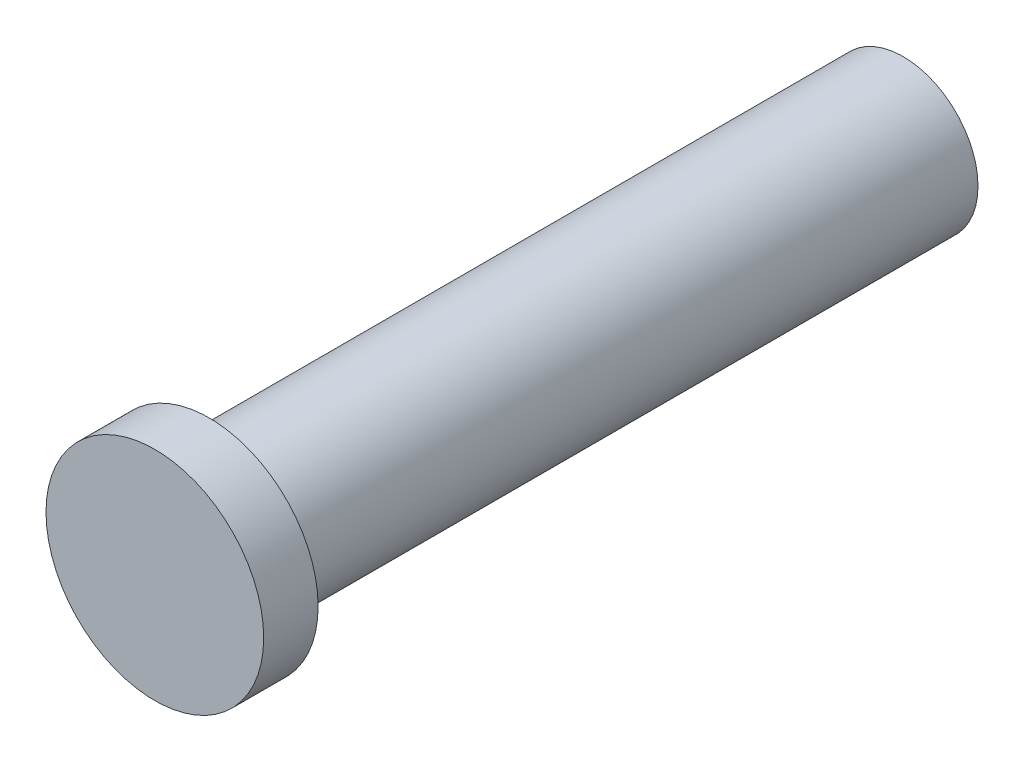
from build123d import *

# Parameters (mm, degrees)
ESBO_O1_R                 = 5.5
RESSALTO_EXTRUS_O1_DEPTH  = 51
ESBO_O2_R                 = 8
RESSALTO_EXTRUS_O2_DEPTH  = 4
FURO_ROSCADO_DE_M51_D     = 4.2
FURO_ROSCADO_DE_M51_DEPTH = 14
FURO_ROSCADO_DE_M51_TIP   = 1.2618073


with BuildPart() as part:
    # Esbo_o1 → Ressalto-extrus_o1 (new body)
    with BuildSketch(Plane.XY):
        Circle(ESBO_O1_R)
    extrude(amount=RESSALTO_EXTRUS_O1_DEPTH)

    # Esbo_o2 → Ressalto-extrus_o2 (add)
    with BuildSketch(Plane.XY.offset(51)):
        Circle(ESBO_O2_R)
    extrude(amount=RESSALTO_EXTRUS_O2_DEPTH)

    # Furo roscado de M51
    with Locations(Plane(origin=(0, 0, 0), x_dir=(-1, 0, 0), z_dir=(0, 0, -1))):
        with Locations((0, 0)):
            Hole(FURO_ROSCADO_DE_M51_D / 2, depth=FURO_ROSCADO_DE_M51_DEPTH)
            with Locations((0, 0, -(FURO_ROSCADO_DE_M51_DEPTH + FURO_ROSCADO_DE_M51_TIP / 2))):  # 118° drill point
                Cone(0, FURO_ROSCADO_DE_M51_D / 2, FURO_ROSCADO_DE_M51_TIP, mode=Mode.SUBTRACT)


solid = part.part
